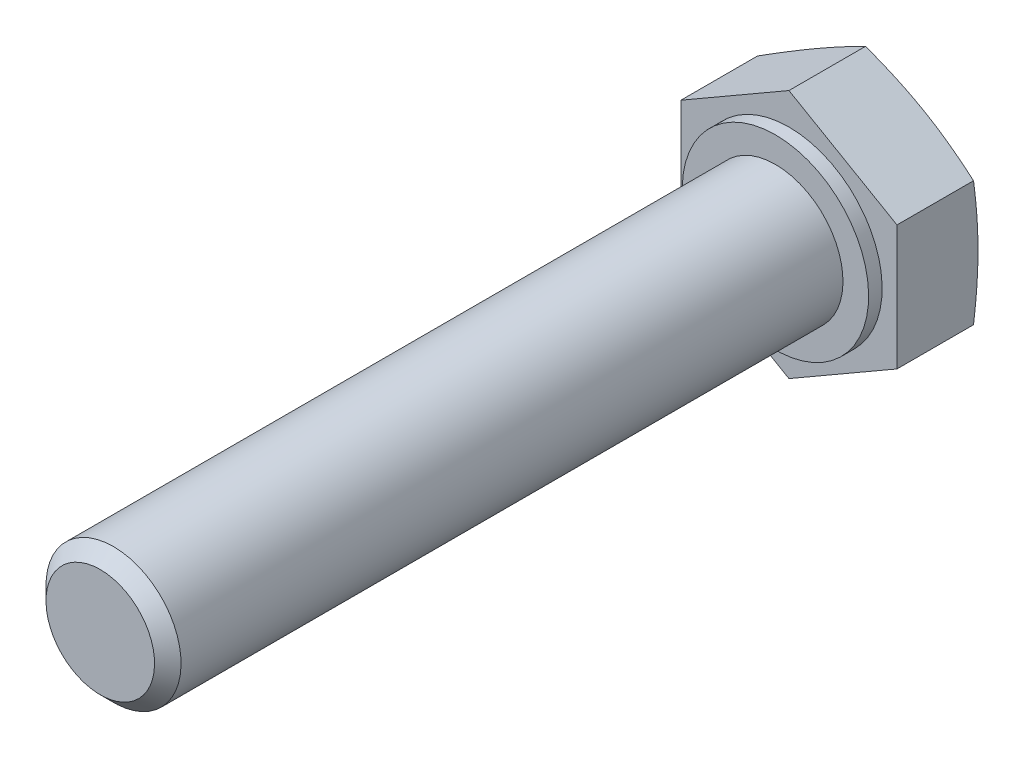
ISO-10303-21;
HEADER;
FILE_DESCRIPTION(('STEP AP214'),'2;1');
FILE_NAME('part.step','',(''),(''),'','','');
FILE_SCHEMA(('AUTOMOTIVE_DESIGN { 1 0 10303 214 1 1 1 1 }'));
ENDSEC;
DATA;
#1=APPLICATION_CONTEXT('core data for automotive mechanical design processes');
#2=APPLICATION_PROTOCOL_DEFINITION('international standard','automotive_design',2000,#1);
#3=PRODUCT_CONTEXT('',#1,'mechanical');
#4=PRODUCT('Part','Part','',(#3));
#5=PRODUCT_RELATED_PRODUCT_CATEGORY('part','',(#4));
#6=PRODUCT_DEFINITION_FORMATION('','',#4);
#7=PRODUCT_DEFINITION_CONTEXT('part definition',#1,'design');
#8=PRODUCT_DEFINITION('design','',#6,#7);
#9=PRODUCT_DEFINITION_SHAPE('','',#8);
#10=(LENGTH_UNIT() NAMED_UNIT(*) SI_UNIT(.MILLI.,.METRE.));
#11=(NAMED_UNIT(*) PLANE_ANGLE_UNIT() SI_UNIT($,.RADIAN.));
#12=(NAMED_UNIT(*) SI_UNIT($,.STERADIAN.) SOLID_ANGLE_UNIT());
#13=UNCERTAINTY_MEASURE_WITH_UNIT(LENGTH_MEASURE(1.E-05),#10,'distance_accuracy_value','');
#14=(GEOMETRIC_REPRESENTATION_CONTEXT(3) GLOBAL_UNCERTAINTY_ASSIGNED_CONTEXT((#13)) GLOBAL_UNIT_ASSIGNED_CONTEXT((#10,
#11,#12)) REPRESENTATION_CONTEXT('',''));
#15=CARTESIAN_POINT('',(0.,0.,0.));
#16=DIRECTION('',(0.,0.,1.));
#17=DIRECTION('',(1.,0.,0.));
#18=AXIS2_PLACEMENT_3D('',#15,#16,#17);
#19=CARTESIAN_POINT('',(0.,-8.,3.));
#20=DIRECTION('',(0.,0.,1.));
#21=DIRECTION('',(0.,-1.,0.));
#22=AXIS2_PLACEMENT_3D('',#19,#20,#21);
#23=PLANE('',#22);
#24=CARTESIAN_POINT('',(0.,0.,3.));
#25=DIRECTION('',(0.,0.,-1.));
#26=DIRECTION('',(0.,1.,0.));
#27=AXIS2_PLACEMENT_3D('',#24,#25,#26);
#28=CIRCLE('',#27,3.45);
#29=CARTESIAN_POINT('',(0.,3.45,3.));
#30=VERTEX_POINT('',#29);
#31=EDGE_CURVE('E159',#30,#30,#28,.T.);
#32=ORIENTED_EDGE('',*,*,#31,.T.);
#33=EDGE_LOOP('',(#32));
#34=FACE_BOUND('',#33,.T.);
#35=DIRECTION('',(0.,1.,0.));
#36=VECTOR('',#35,1.);
#37=CARTESIAN_POINT('',(4.,-8.,3.));
#38=LINE('',#37,#36);
#39=CARTESIAN_POINT('',(4.,-2.30940107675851,3.));
#40=VERTEX_POINT('',#39);
#41=CARTESIAN_POINT('',(4.,2.30940107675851,3.));
#42=VERTEX_POINT('',#41);
#43=EDGE_CURVE('E161',#40,#42,#38,.T.);
#44=ORIENTED_EDGE('',*,*,#43,.T.);
#45=DIRECTION('',(-0.866025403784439,0.5,0.));
#46=VECTOR('',#45,1.);
#47=CARTESIAN_POINT('',(5.46410161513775,1.46410161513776,3.));
#48=LINE('',#47,#46);
#49=CARTESIAN_POINT('',(0.,4.61880215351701,3.));
#50=VERTEX_POINT('',#49);
#51=EDGE_CURVE('E9',#42,#50,#48,.T.);
#52=ORIENTED_EDGE('',*,*,#51,.T.);
#53=DIRECTION('',(-0.866025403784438,-0.5,0.));
#54=VECTOR('',#53,1.);
#55=CARTESIAN_POINT('',(-5.46410161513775,1.46410161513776,3.));
#56=LINE('',#55,#54);
#57=CARTESIAN_POINT('',(-4.,2.30940107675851,3.));
#58=VERTEX_POINT('',#57);
#59=EDGE_CURVE('E22',#50,#58,#56,.T.);
#60=ORIENTED_EDGE('',*,*,#59,.T.);
#61=DIRECTION('',(0.,-1.,0.));
#62=VECTOR('',#61,1.);
#63=CARTESIAN_POINT('',(-4.,-8.,3.));
#64=LINE('',#63,#62);
#65=CARTESIAN_POINT('',(-4.,-2.30940107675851,3.));
#66=VERTEX_POINT('',#65);
#67=EDGE_CURVE('E174',#58,#66,#64,.T.);
#68=ORIENTED_EDGE('',*,*,#67,.T.);
#69=DIRECTION('',(0.866025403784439,-0.5,0.));
#70=VECTOR('',#69,1.);
#71=CARTESIAN_POINT('',(1.46410161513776,-5.46410161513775,3.));
#72=LINE('',#71,#70);
#73=CARTESIAN_POINT('',(0.,-4.61880215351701,3.));
#74=VERTEX_POINT('',#73);
#75=EDGE_CURVE('E166',#66,#74,#72,.T.);
#76=ORIENTED_EDGE('',*,*,#75,.T.);
#77=DIRECTION('',(0.866025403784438,0.5,0.));
#78=VECTOR('',#77,1.);
#79=CARTESIAN_POINT('',(-1.46410161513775,-5.46410161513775,3.));
#80=LINE('',#79,#78);
#81=EDGE_CURVE('E164',#74,#40,#80,.T.);
#82=ORIENTED_EDGE('',*,*,#81,.T.);
#83=EDGE_LOOP('',(#44,#52,#60,#68,#76,#82));
#84=FACE_BOUND('',#83,.T.);
#85=ADVANCED_FACE('F14',(#34,#84),#23,.T.);
#86=CARTESIAN_POINT('',(0.,0.,28.5));
#87=DIRECTION('',(0.,0.,-1.));
#88=DIRECTION('',(0.,1.,0.));
#89=AXIS2_PLACEMENT_3D('',#86,#87,#88);
#90=CYLINDRICAL_SURFACE('',#89,3.45);
#91=CARTESIAN_POINT('',(0.,0.,3.5));
#92=DIRECTION('',(0.,0.,-1.));
#93=DIRECTION('',(0.,1.,0.));
#94=AXIS2_PLACEMENT_3D('',#91,#92,#93);
#95=CIRCLE('',#94,3.45);
#96=CARTESIAN_POINT('',(0.,3.45,3.5));
#97=VERTEX_POINT('',#96);
#98=EDGE_CURVE('E252',#97,#97,#95,.T.);
#99=ORIENTED_EDGE('',*,*,#98,.T.);
#100=EDGE_LOOP('',(#99));
#101=FACE_BOUND('',#100,.T.);
#102=ORIENTED_EDGE('',*,*,#31,.F.);
#103=EDGE_LOOP('',(#102));
#104=FACE_BOUND('',#103,.T.);
#105=ADVANCED_FACE('F147',(#101,#104),#90,.T.);
#106=CARTESIAN_POINT('',(0.,-3.45,3.5));
#107=DIRECTION('',(0.,0.,1.));
#108=DIRECTION('',(0.,-1.,0.));
#109=AXIS2_PLACEMENT_3D('',#106,#107,#108);
#110=PLANE('',#109);
#111=CARTESIAN_POINT('',(0.,0.,3.5));
#112=DIRECTION('',(0.,0.,-1.));
#113=DIRECTION('',(0.,1.,0.));
#114=AXIS2_PLACEMENT_3D('',#111,#112,#113);
#115=CIRCLE('',#114,2.5);
#116=CARTESIAN_POINT('',(0.,2.5,3.5));
#117=VERTEX_POINT('',#116);
#118=EDGE_CURVE('E254',#117,#117,#115,.T.);
#119=ORIENTED_EDGE('',*,*,#118,.T.);
#120=EDGE_LOOP('',(#119));
#121=FACE_BOUND('',#120,.T.);
#122=ORIENTED_EDGE('',*,*,#98,.F.);
#123=EDGE_LOOP('',(#122));
#124=FACE_BOUND('',#123,.T.);
#125=ADVANCED_FACE('F143',(#121,#124),#110,.T.);
#126=CARTESIAN_POINT('',(0.,0.,28.5));
#127=DIRECTION('',(0.,0.,-1.));
#128=DIRECTION('',(0.,1.,0.));
#129=AXIS2_PLACEMENT_3D('',#126,#127,#128);
#130=CYLINDRICAL_SURFACE('',#129,2.5);
#131=CARTESIAN_POINT('',(0.,0.,28.0095));
#132=DIRECTION('',(0.,0.,-1.));
#133=DIRECTION('',(0.,1.,0.));
#134=AXIS2_PLACEMENT_3D('',#131,#132,#133);
#135=CIRCLE('',#134,2.5);
#136=CARTESIAN_POINT('',(0.,2.5,28.0095));
#137=VERTEX_POINT('',#136);
#138=EDGE_CURVE('E258',#137,#137,#135,.T.);
#139=ORIENTED_EDGE('',*,*,#138,.T.);
#140=EDGE_LOOP('',(#139));
#141=FACE_BOUND('',#140,.T.);
#142=ORIENTED_EDGE('',*,*,#118,.F.);
#143=EDGE_LOOP('',(#142));
#144=FACE_BOUND('',#143,.T.);
#145=ADVANCED_FACE('F139',(#141,#144),#130,.T.);
#146=CARTESIAN_POINT('',(0.,0.,28.0095));
#147=DIRECTION('',(0.,0.,-1.));
#148=DIRECTION('',(0.,1.,0.));
#149=AXIS2_PLACEMENT_3D('',#146,#147,#148);
#150=CONICAL_SURFACE('',#149,2.5,0.785398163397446);
#151=CARTESIAN_POINT('',(0.,0.,28.5));
#152=DIRECTION('',(0.,0.,-1.));
#153=DIRECTION('',(0.,1.,0.));
#154=AXIS2_PLACEMENT_3D('',#151,#152,#153);
#155=CIRCLE('',#154,2.0095);
#156=CARTESIAN_POINT('',(0.,2.0095,28.5));
#157=VERTEX_POINT('',#156);
#158=EDGE_CURVE('E105',#157,#157,#155,.T.);
#159=ORIENTED_EDGE('',*,*,#158,.T.);
#160=EDGE_LOOP('',(#159));
#161=FACE_BOUND('',#160,.T.);
#162=ORIENTED_EDGE('',*,*,#138,.F.);
#163=EDGE_LOOP('',(#162));
#164=FACE_BOUND('',#163,.T.);
#165=ADVANCED_FACE('F135',(#161,#164),#150,.T.);
#166=CARTESIAN_POINT('',(0.,-2.0095,28.5));
#167=DIRECTION('',(0.,0.,1.));
#168=DIRECTION('',(0.,-1.,0.));
#169=AXIS2_PLACEMENT_3D('',#166,#167,#168);
#170=PLANE('',#169);
#171=ORIENTED_EDGE('',*,*,#158,.F.);
#172=EDGE_LOOP('',(#171));
#173=FACE_BOUND('',#172,.T.);
#174=ADVANCED_FACE('F130',(#173),#170,.T.);
#175=CARTESIAN_POINT('',(4.,2.30940107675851,0.));
#176=DIRECTION('',(0.5,0.866025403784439,0.));
#177=DIRECTION('',(-0.866025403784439,0.5,0.));
#178=AXIS2_PLACEMENT_3D('',#175,#176,#177);
#179=PLANE('',#178);
#180=DIRECTION('',(0.,0.,1.));
#181=VECTOR('',#180,1.);
#182=CARTESIAN_POINT('',(0.,4.61880215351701,0.));
#183=LINE('',#182,#181);
#184=CARTESIAN_POINT('',(0.,4.61880215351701,0.16580753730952));
#185=VERTEX_POINT('',#184);
#186=EDGE_CURVE('E179',#185,#50,#183,.T.);
#187=ORIENTED_EDGE('',*,*,#186,.T.);
#188=ORIENTED_EDGE('',*,*,#51,.F.);
#189=DIRECTION('',(0.,0.,1.));
#190=VECTOR('',#189,1.);
#191=CARTESIAN_POINT('',(4.,2.30940107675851,0.));
#192=LINE('',#191,#190);
#193=CARTESIAN_POINT('',(4.,2.30940107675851,0.16580753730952));
#194=VERTEX_POINT('',#193);
#195=EDGE_CURVE('E35',#194,#42,#192,.T.);
#196=ORIENTED_EDGE('',*,*,#195,.F.);
#197=CARTESIAN_POINT('',(-0.000199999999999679,4.61891762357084,0.165838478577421));
#198=CARTESIAN_POINT('',(0.165926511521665,4.52300443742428,0.140126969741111));
#199=CARTESIAN_POINT('',(0.33235424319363,4.42691734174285,0.116785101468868));
#200=CARTESIAN_POINT('',(0.665797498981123,4.23440378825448,0.0757755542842));
#201=CARTESIAN_POINT('',(0.832813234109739,4.13797720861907,0.0581101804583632));
#202=CARTESIAN_POINT('',(1.16641980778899,3.94536936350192,0.0294849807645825));
#203=CARTESIAN_POINT('',(1.33300839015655,3.84918940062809,0.0184910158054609));
#204=CARTESIAN_POINT('',(1.66639801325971,3.65670681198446,0.00374922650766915));
#205=CARTESIAN_POINT('',(1.83319900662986,3.56040421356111,0.));
#206=CARTESIAN_POINT('',(2.16680099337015,3.3677990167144,0.));
#207=CARTESIAN_POINT('',(2.3336019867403,3.27149641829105,0.00374922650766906));
#208=CARTESIAN_POINT('',(2.66699160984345,3.07901382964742,0.0184910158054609));
#209=CARTESIAN_POINT('',(2.83358019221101,2.98283386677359,0.0294849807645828));
#210=CARTESIAN_POINT('',(3.16718676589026,2.79022602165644,0.0581101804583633));
#211=CARTESIAN_POINT('',(3.33420250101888,2.69379944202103,0.0757755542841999));
#212=CARTESIAN_POINT('',(3.66764575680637,2.50128588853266,0.116785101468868));
#213=CARTESIAN_POINT('',(3.83407348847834,2.40519879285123,0.140126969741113));
#214=CARTESIAN_POINT('',(4.0002,2.30928560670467,0.165838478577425));
#215=B_SPLINE_CURVE_WITH_KNOTS('',3,(#197,#198,#199,#200,#201,#202,#203,#204,#205,#206,#207,
#208,#209,#210,#211,#212,#213,#214),.UNSPECIFIED.,.F.,.F.,(4,2,2,2,2,2,2,2,4),(0.,
0.580655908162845,1.1615473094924,1.73944052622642,2.31722188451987,2.89500324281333,
3.47289645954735,4.0537878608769,4.63444376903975),.UNSPECIFIED.);
#216=CARTESIAN_POINT('',(2.,3.46410161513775,0.));
#217=VERTEX_POINT('',#216);
#218=EDGE_CURVE('E95',#217,#194,#215,.T.);
#219=ORIENTED_EDGE('',*,*,#218,.F.);
#220=EDGE_CURVE('E102',#185,#217,#215,.T.);
#221=ORIENTED_EDGE('',*,*,#220,.F.);
#222=EDGE_LOOP('',(#187,#188,#196,#219,#221));
#223=FACE_BOUND('',#222,.T.);
#224=ADVANCED_FACE('F94',(#223),#179,.T.);
#225=CARTESIAN_POINT('',(0.,4.61880215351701,0.));
#226=DIRECTION('',(-0.5,0.866025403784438,0.));
#227=DIRECTION('',(-0.866025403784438,-0.5,0.));
#228=AXIS2_PLACEMENT_3D('',#225,#226,#227);
#229=PLANE('',#228);
#230=DIRECTION('',(0.,0.,1.));
#231=VECTOR('',#230,1.);
#232=CARTESIAN_POINT('',(-4.,2.30940107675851,0.));
#233=LINE('',#232,#231);
#234=CARTESIAN_POINT('',(-4.,2.30940107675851,0.165807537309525));
#235=VERTEX_POINT('',#234);
#236=EDGE_CURVE('E182',#235,#58,#233,.T.);
#237=ORIENTED_EDGE('',*,*,#236,.T.);
#238=ORIENTED_EDGE('',*,*,#59,.F.);
#239=ORIENTED_EDGE('',*,*,#186,.F.);
#240=CARTESIAN_POINT('',(-4.0002,2.30928560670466,0.165838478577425));
#241=CARTESIAN_POINT('',(-3.83407348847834,2.40519879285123,0.140126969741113));
#242=CARTESIAN_POINT('',(-3.66764575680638,2.50128588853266,0.116785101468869));
#243=CARTESIAN_POINT('',(-3.33420250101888,2.69379944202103,0.0757755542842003));
#244=CARTESIAN_POINT('',(-3.16718676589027,2.79022602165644,0.0581101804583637));
#245=CARTESIAN_POINT('',(-2.83358019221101,2.98283386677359,0.0294849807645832));
#246=CARTESIAN_POINT('',(-2.66699160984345,3.07901382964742,0.0184910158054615));
#247=CARTESIAN_POINT('',(-2.3336019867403,3.27149641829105,0.00374922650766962));
#248=CARTESIAN_POINT('',(-2.16680099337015,3.3677990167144,0.));
#249=CARTESIAN_POINT('',(-1.83319900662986,3.56040421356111,0.));
#250=CARTESIAN_POINT('',(-1.66639801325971,3.65670681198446,0.00374922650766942));
#251=CARTESIAN_POINT('',(-1.33300839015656,3.84918940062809,0.0184910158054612));
#252=CARTESIAN_POINT('',(-1.16641980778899,3.94536936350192,0.0294849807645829));
#253=CARTESIAN_POINT('',(-0.832813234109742,4.13797720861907,0.0581101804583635));
#254=CARTESIAN_POINT('',(-0.665797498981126,4.23440378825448,0.0757755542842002));
#255=CARTESIAN_POINT('',(-0.332354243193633,4.42691734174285,0.116785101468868));
#256=CARTESIAN_POINT('',(-0.165926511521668,4.52300443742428,0.140126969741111));
#257=CARTESIAN_POINT('',(0.000199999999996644,4.61891762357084,0.165838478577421));
#258=B_SPLINE_CURVE_WITH_KNOTS('',3,(#240,#241,#242,#243,#244,#245,#246,#247,#248,#249,#250,
#251,#252,#253,#254,#255,#256,#257),.UNSPECIFIED.,.F.,.F.,(4,2,2,2,2,2,2,2,4),(0.,
0.580655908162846,1.1615473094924,1.73944052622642,2.31722188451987,2.89500324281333,
3.47289645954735,4.0537878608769,4.63444376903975),.UNSPECIFIED.);
#259=CARTESIAN_POINT('',(-2.,3.46410161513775,0.));
#260=VERTEX_POINT('',#259);
#261=EDGE_CURVE('E107',#260,#185,#258,.T.);
#262=ORIENTED_EDGE('',*,*,#261,.F.);
#263=EDGE_CURVE('E103',#235,#260,#258,.T.);
#264=ORIENTED_EDGE('',*,*,#263,.F.);
#265=EDGE_LOOP('',(#237,#238,#239,#262,#264));
#266=FACE_BOUND('',#265,.T.);
#267=ADVANCED_FACE('F129',(#266),#229,.T.);
#268=CARTESIAN_POINT('',(-4.,2.30940107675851,0.));
#269=DIRECTION('',(-1.,0.,0.));
#270=DIRECTION('',(0.,-1.,0.));
#271=AXIS2_PLACEMENT_3D('',#268,#269,#270);
#272=PLANE('',#271);
#273=DIRECTION('',(0.,0.,1.));
#274=VECTOR('',#273,1.);
#275=CARTESIAN_POINT('',(-4.,-2.30940107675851,0.));
#276=LINE('',#275,#274);
#277=CARTESIAN_POINT('',(-4.,-2.30940107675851,0.165807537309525));
#278=VERTEX_POINT('',#277);
#279=EDGE_CURVE('E184',#278,#66,#276,.T.);
#280=ORIENTED_EDGE('',*,*,#279,.T.);
#281=ORIENTED_EDGE('',*,*,#67,.F.);
#282=ORIENTED_EDGE('',*,*,#236,.F.);
#283=CARTESIAN_POINT('',(-4.,6.17119683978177,0.898744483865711));
#284=CARTESIAN_POINT('',(-4.,5.98899751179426,0.857788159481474));
#285=CARTESIAN_POINT('',(-4.,5.80668598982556,0.817322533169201));
#286=CARTESIAN_POINT('',(-4.,5.44178313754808,0.737637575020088));
#287=CARTESIAN_POINT('',(-4.,5.25919179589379,0.69841829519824));
#288=CARTESIAN_POINT('',(-4.,4.89351973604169,0.621458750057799));
#289=CARTESIAN_POINT('',(-4.,4.71043872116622,0.583719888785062));
#290=CARTESIAN_POINT('',(-4.,4.34390065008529,0.510118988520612));
#291=CARTESIAN_POINT('',(-4.,4.16044359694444,0.474256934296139));
#292=CARTESIAN_POINT('',(-4.,3.79457455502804,0.405137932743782));
#293=CARTESIAN_POINT('',(-4.,3.61216614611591,0.371862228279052));
#294=CARTESIAN_POINT('',(-4.,3.24685513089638,0.30815123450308));
#295=CARTESIAN_POINT('',(-4.,3.06395251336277,0.27771601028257));
#296=CARTESIAN_POINT('',(-4.,2.51443513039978,0.191656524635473));
#297=CARTESIAN_POINT('',(-4.,2.14694554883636,0.141265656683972));
#298=CARTESIAN_POINT('',(-4.,1.59190230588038,0.0808604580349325));
#299=CARTESIAN_POINT('',(-4.,1.40517901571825,0.0631992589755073));
#300=CARTESIAN_POINT('',(-4.,1.03124682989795,0.0340086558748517));
#301=CARTESIAN_POINT('',(-4.,0.844037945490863,0.0224791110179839));
#302=CARTESIAN_POINT('',(-4.,0.469412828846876,0.00621961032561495));
#303=CARTESIAN_POINT('',(-4.,0.281996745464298,0.00148628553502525));
#304=CARTESIAN_POINT('',(-4.,-0.0928810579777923,-0.00088742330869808));
#305=CARTESIAN_POINT('',(-4.,-0.280342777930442,0.00147217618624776));
#306=CARTESIAN_POINT('',(-4.,-0.655761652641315,0.0131530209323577));
#307=CARTESIAN_POINT('',(-4.,-0.843717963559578,0.0225008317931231));
#308=CARTESIAN_POINT('',(-4.,-1.21919691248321,0.0476203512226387));
#309=CARTESIAN_POINT('',(-4.,-1.4067195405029,0.0633922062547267));
#310=CARTESIAN_POINT('',(-4.,-1.78132954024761,0.100547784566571));
#311=CARTESIAN_POINT('',(-4.,-1.96841652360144,0.121935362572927));
#312=CARTESIAN_POINT('',(-4.,-2.34198560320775,0.16941383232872));
#313=CARTESIAN_POINT('',(-4.,-2.52846769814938,0.195504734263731));
#314=CARTESIAN_POINT('',(-4.,-2.89981892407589,0.251380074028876));
#315=CARTESIAN_POINT('',(-4.,-3.08469127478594,0.281143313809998));
#316=CARTESIAN_POINT('',(-4.,-3.45391519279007,0.343755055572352));
#317=CARTESIAN_POINT('',(-4.,-3.63826674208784,0.376603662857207));
#318=CARTESIAN_POINT('',(-4.,-4.19067442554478,0.478849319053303));
#319=CARTESIAN_POINT('',(-4.,-4.55804485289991,0.551940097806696));
#320=CARTESIAN_POINT('',(-4.,-5.29155686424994,0.704515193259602));
#321=CARTESIAN_POINT('',(-4.,-5.65769800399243,0.784001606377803));
#322=CARTESIAN_POINT('',(-4.,-6.38899634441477,0.947239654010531));
#323=CARTESIAN_POINT('',(-3.99999999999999,-6.75415361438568,1.03099097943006));
#324=CARTESIAN_POINT('',(-3.99999999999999,-7.47987161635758,1.20052176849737));
#325=CARTESIAN_POINT('',(-3.99999999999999,-7.84043970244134,1.28626991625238));
#326=CARTESIAN_POINT('',(-3.99999999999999,-8.56108756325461,1.4598245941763));
#327=CARTESIAN_POINT('',(-3.99999999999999,-8.92116732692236,1.54763117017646));
#328=CARTESIAN_POINT('',(-3.99999999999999,-9.64044653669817,1.72462114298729));
#329=CARTESIAN_POINT('',(-3.99999999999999,-9.9996465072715,1.81380241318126));
#330=CARTESIAN_POINT('',(-3.99999999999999,-10.717746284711,1.99331080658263));
#331=CARTESIAN_POINT('',(-3.99999999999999,-11.0766461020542,2.08363788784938));
#332=CARTESIAN_POINT('',(-4.,-11.4354435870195,2.17436506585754));
#333=B_SPLINE_CURVE_WITH_KNOTS('',3,(#283,#284,#285,#286,#287,#288,#289,#290,#291,#292,#293,
#294,#295,#296,#297,#298,#299,#300,#301,#302,#303,#304,#305,#306,#307,#308,#309,#310,#311,#312,
#313,#314,#315,#316,#317,#318,#319,#320,#321,#322,#323,#324,#325,#326,#327,#328,#329,#330,#331,
#332),.UNSPECIFIED.,.F.,.F.,(4,2,2,2,2,2,2,2,2,2,2,2,2,2,2,2,2,2,2,2,2,2,2,2,4),(0.,
0.560239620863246,1.12050259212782,1.68128467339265,2.24206220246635,2.79829502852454,
3.35454059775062,4.46683223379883,5.02942093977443,5.59199672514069,6.15429353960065,
6.71658904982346,7.28103305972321,7.84548993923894,8.41033528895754,8.97518186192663,
9.53690839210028,10.0986541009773,11.2222631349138,12.3462419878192,13.4701394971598,
14.5820036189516,15.69389252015,16.8042063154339,17.9144795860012),.UNSPECIFIED.);
#334=CARTESIAN_POINT('',(-4.,0.,0.));
#335=VERTEX_POINT('',#334);
#336=EDGE_CURVE('E220',#335,#235,#333,.F.);
#337=ORIENTED_EDGE('',*,*,#336,.F.);
#338=EDGE_CURVE('E226',#278,#335,#333,.F.);
#339=ORIENTED_EDGE('',*,*,#338,.F.);
#340=EDGE_LOOP('',(#280,#281,#282,#337,#339));
#341=FACE_BOUND('',#340,.T.);
#342=ADVANCED_FACE('F214',(#341),#272,.T.);
#343=CARTESIAN_POINT('',(-4.,-2.30940107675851,0.));
#344=DIRECTION('',(-0.5,-0.866025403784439,0.));
#345=DIRECTION('',(0.866025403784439,-0.5,0.));
#346=AXIS2_PLACEMENT_3D('',#343,#344,#345);
#347=PLANE('',#346);
#348=DIRECTION('',(0.,0.,1.));
#349=VECTOR('',#348,1.);
#350=CARTESIAN_POINT('',(0.,-4.61880215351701,0.));
#351=LINE('',#350,#349);
#352=CARTESIAN_POINT('',(0.,-4.61880215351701,0.16580753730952));
#353=VERTEX_POINT('',#352);
#354=EDGE_CURVE('E272',#353,#74,#351,.T.);
#355=ORIENTED_EDGE('',*,*,#354,.T.);
#356=ORIENTED_EDGE('',*,*,#75,.F.);
#357=ORIENTED_EDGE('',*,*,#279,.F.);
#358=CARTESIAN_POINT('',(0.000199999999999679,-4.61891762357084,0.165838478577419));
#359=CARTESIAN_POINT('',(-0.165926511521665,-4.52300443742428,0.140126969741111));
#360=CARTESIAN_POINT('',(-0.33235424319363,-4.42691734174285,0.116785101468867));
#361=CARTESIAN_POINT('',(-0.665797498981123,-4.23440378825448,0.0757755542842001));
#362=CARTESIAN_POINT('',(-0.832813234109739,-4.13797720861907,0.0581101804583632));
#363=CARTESIAN_POINT('',(-1.16641980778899,-3.94536936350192,0.0294849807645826));
#364=CARTESIAN_POINT('',(-1.33300839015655,-3.84918940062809,0.0184910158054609));
#365=CARTESIAN_POINT('',(-1.66639801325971,-3.65670681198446,0.00374922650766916));
#366=CARTESIAN_POINT('',(-1.83319900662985,-3.56040421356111,0.));
#367=CARTESIAN_POINT('',(-2.16680099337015,-3.3677990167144,0.));
#368=CARTESIAN_POINT('',(-2.33360198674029,-3.27149641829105,0.00374922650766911));
#369=CARTESIAN_POINT('',(-2.66699160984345,-3.07901382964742,0.0184910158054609));
#370=CARTESIAN_POINT('',(-2.83358019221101,-2.98283386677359,0.0294849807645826));
#371=CARTESIAN_POINT('',(-3.16718676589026,-2.79022602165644,0.0581101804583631));
#372=CARTESIAN_POINT('',(-3.33420250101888,-2.69379944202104,0.0757755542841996));
#373=CARTESIAN_POINT('',(-3.66764575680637,-2.50128588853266,0.116785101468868));
#374=CARTESIAN_POINT('',(-3.83407348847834,-2.40519879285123,0.140126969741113));
#375=CARTESIAN_POINT('',(-4.0002,-2.30928560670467,0.165838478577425));
#376=B_SPLINE_CURVE_WITH_KNOTS('',3,(#358,#359,#360,#361,#362,#363,#364,#365,#366,#367,#368,
#369,#370,#371,#372,#373,#374,#375),.UNSPECIFIED.,.F.,.F.,(4,2,2,2,2,2,2,2,4),(0.,
0.580655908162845,1.1615473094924,1.73944052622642,2.31722188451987,2.89500324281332,
3.47289645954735,4.0537878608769,4.63444376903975),.UNSPECIFIED.);
#377=CARTESIAN_POINT('',(-2.,-3.46410161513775,0.));
#378=VERTEX_POINT('',#377);
#379=EDGE_CURVE('E200',#378,#278,#376,.T.);
#380=ORIENTED_EDGE('',*,*,#379,.F.);
#381=EDGE_CURVE('E227',#353,#378,#376,.T.);
#382=ORIENTED_EDGE('',*,*,#381,.F.);
#383=EDGE_LOOP('',(#355,#356,#357,#380,#382));
#384=FACE_BOUND('',#383,.T.);
#385=ADVANCED_FACE('F209',(#384),#347,.T.);
#386=CARTESIAN_POINT('',(0.,-4.61880215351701,0.));
#387=DIRECTION('',(0.5,-0.866025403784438,0.));
#388=DIRECTION('',(0.866025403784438,0.5,0.));
#389=AXIS2_PLACEMENT_3D('',#386,#387,#388);
#390=PLANE('',#389);
#391=DIRECTION('',(0.,0.,1.));
#392=VECTOR('',#391,1.);
#393=CARTESIAN_POINT('',(4.,-2.30940107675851,0.));
#394=LINE('',#393,#392);
#395=CARTESIAN_POINT('',(4.,-2.30940107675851,0.16580753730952));
#396=VERTEX_POINT('',#395);
#397=EDGE_CURVE('E29',#396,#40,#394,.T.);
#398=ORIENTED_EDGE('',*,*,#397,.T.);
#399=ORIENTED_EDGE('',*,*,#81,.F.);
#400=ORIENTED_EDGE('',*,*,#354,.F.);
#401=CARTESIAN_POINT('',(4.0002,-2.30928560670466,0.165838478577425));
#402=CARTESIAN_POINT('',(3.83407348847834,-2.40519879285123,0.140126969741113));
#403=CARTESIAN_POINT('',(3.66764575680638,-2.50128588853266,0.116785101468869));
#404=CARTESIAN_POINT('',(3.33420250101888,-2.69379944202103,0.0757755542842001));
#405=CARTESIAN_POINT('',(3.16718676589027,-2.79022602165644,0.0581101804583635));
#406=CARTESIAN_POINT('',(2.83358019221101,-2.98283386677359,0.029484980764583));
#407=CARTESIAN_POINT('',(2.66699160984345,-3.07901382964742,0.0184910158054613));
#408=CARTESIAN_POINT('',(2.3336019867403,-3.27149641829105,0.00374922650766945));
#409=CARTESIAN_POINT('',(2.16680099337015,-3.3677990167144,0.));
#410=CARTESIAN_POINT('',(1.83319900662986,-3.56040421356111,0.));
#411=CARTESIAN_POINT('',(1.66639801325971,-3.65670681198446,0.00374922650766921));
#412=CARTESIAN_POINT('',(1.33300839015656,-3.84918940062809,0.0184910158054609));
#413=CARTESIAN_POINT('',(1.166419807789,-3.94536936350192,0.0294849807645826));
#414=CARTESIAN_POINT('',(0.832813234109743,-4.13797720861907,0.0581101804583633));
#415=CARTESIAN_POINT('',(0.665797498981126,-4.23440378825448,0.0757755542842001));
#416=CARTESIAN_POINT('',(0.332354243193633,-4.42691734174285,0.116785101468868));
#417=CARTESIAN_POINT('',(0.165926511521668,-4.52300443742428,0.140126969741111));
#418=CARTESIAN_POINT('',(-0.000199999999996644,-4.61891762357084,0.165838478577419));
#419=B_SPLINE_CURVE_WITH_KNOTS('',3,(#401,#402,#403,#404,#405,#406,#407,#408,#409,#410,#411,
#412,#413,#414,#415,#416,#417,#418),.UNSPECIFIED.,.F.,.F.,(4,2,2,2,2,2,2,2,4),(0.,
0.580655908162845,1.1615473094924,1.73944052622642,2.31722188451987,2.89500324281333,
3.47289645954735,4.0537878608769,4.63444376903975),.UNSPECIFIED.);
#420=CARTESIAN_POINT('',(2.,-3.46410161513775,0.));
#421=VERTEX_POINT('',#420);
#422=EDGE_CURVE('E90',#421,#353,#419,.T.);
#423=ORIENTED_EDGE('',*,*,#422,.F.);
#424=EDGE_CURVE('E199',#396,#421,#419,.T.);
#425=ORIENTED_EDGE('',*,*,#424,.F.);
#426=EDGE_LOOP('',(#398,#399,#400,#423,#425));
#427=FACE_BOUND('',#426,.T.);
#428=ADVANCED_FACE('F206',(#427),#390,.T.);
#429=CARTESIAN_POINT('',(4.,-2.30940107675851,0.));
#430=DIRECTION('',(1.,0.,0.));
#431=DIRECTION('',(0.,1.,0.));
#432=AXIS2_PLACEMENT_3D('',#429,#430,#431);
#433=PLANE('',#432);
#434=ORIENTED_EDGE('',*,*,#195,.T.);
#435=ORIENTED_EDGE('',*,*,#43,.F.);
#436=ORIENTED_EDGE('',*,*,#397,.F.);
#437=CARTESIAN_POINT('',(4.,6.17119683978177,0.898744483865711));
#438=CARTESIAN_POINT('',(4.,5.98899751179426,0.857788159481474));
#439=CARTESIAN_POINT('',(4.,5.80668598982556,0.8173225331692));
#440=CARTESIAN_POINT('',(3.99999999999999,5.44178313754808,0.737637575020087));
#441=CARTESIAN_POINT('',(4.,5.25919179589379,0.698418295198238));
#442=CARTESIAN_POINT('',(4.,4.89351973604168,0.621458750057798));
#443=CARTESIAN_POINT('',(4.,4.71043872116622,0.58371988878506));
#444=CARTESIAN_POINT('',(4.,4.34390065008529,0.510118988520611));
#445=CARTESIAN_POINT('',(4.,4.16044359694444,0.474256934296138));
#446=CARTESIAN_POINT('',(4.,3.79457455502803,0.405137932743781));
#447=CARTESIAN_POINT('',(4.,3.61216614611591,0.371862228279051));
#448=CARTESIAN_POINT('',(4.,3.24685513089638,0.308151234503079));
#449=CARTESIAN_POINT('',(4.,3.06395251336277,0.277716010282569));
#450=CARTESIAN_POINT('',(4.,2.51443513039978,0.191656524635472));
#451=CARTESIAN_POINT('',(4.,2.14694554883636,0.141265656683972));
#452=CARTESIAN_POINT('',(4.,1.59190230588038,0.0808604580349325));
#453=CARTESIAN_POINT('',(4.,1.40517901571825,0.063199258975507));
#454=CARTESIAN_POINT('',(4.,1.03124682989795,0.034008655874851));
#455=CARTESIAN_POINT('',(4.,0.844037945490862,0.0224791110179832));
#456=CARTESIAN_POINT('',(4.,0.469412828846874,0.0062196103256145));
#457=CARTESIAN_POINT('',(4.,0.281996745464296,0.00148628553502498));
#458=CARTESIAN_POINT('',(4.,-0.0928810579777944,-0.000887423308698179));
#459=CARTESIAN_POINT('',(4.,-0.280342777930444,0.00147217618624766));
#460=CARTESIAN_POINT('',(4.,-0.655761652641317,0.0131530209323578));
#461=CARTESIAN_POINT('',(4.,-0.843717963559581,0.0225008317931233));
#462=CARTESIAN_POINT('',(4.,-1.21919691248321,0.0476203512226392));
#463=CARTESIAN_POINT('',(4.,-1.4067195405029,0.0633922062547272));
#464=CARTESIAN_POINT('',(4.,-1.78132954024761,0.100547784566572));
#465=CARTESIAN_POINT('',(4.,-1.96841652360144,0.121935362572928));
#466=CARTESIAN_POINT('',(4.,-2.34198560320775,0.16941383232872));
#467=CARTESIAN_POINT('',(4.,-2.52846769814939,0.195504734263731));
#468=CARTESIAN_POINT('',(4.,-2.8998189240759,0.251380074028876));
#469=CARTESIAN_POINT('',(4.,-3.08469127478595,0.281143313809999));
#470=CARTESIAN_POINT('',(4.,-3.45391519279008,0.343755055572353));
#471=CARTESIAN_POINT('',(4.,-3.63826674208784,0.376603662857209));
#472=CARTESIAN_POINT('',(4.,-4.19067442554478,0.478849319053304));
#473=CARTESIAN_POINT('',(4.,-4.55804485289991,0.551940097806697));
#474=CARTESIAN_POINT('',(4.,-5.29155686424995,0.704515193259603));
#475=CARTESIAN_POINT('',(4.,-5.65769800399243,0.784001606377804));
#476=CARTESIAN_POINT('',(4.,-6.38899634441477,0.947239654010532));
#477=CARTESIAN_POINT('',(4.,-6.75415361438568,1.03099097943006));
#478=CARTESIAN_POINT('',(4.,-7.47987161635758,1.20052176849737));
#479=CARTESIAN_POINT('',(4.,-7.84043970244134,1.28626991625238));
#480=CARTESIAN_POINT('',(4.,-8.56108756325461,1.4598245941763));
#481=CARTESIAN_POINT('',(4.,-8.92116732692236,1.54763117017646));
#482=CARTESIAN_POINT('',(4.,-9.64044653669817,1.72462114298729));
#483=CARTESIAN_POINT('',(4.,-9.9996465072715,1.81380241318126));
#484=CARTESIAN_POINT('',(4.,-10.717746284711,1.99331080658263));
#485=CARTESIAN_POINT('',(4.,-11.0766461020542,2.08363788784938));
#486=CARTESIAN_POINT('',(4.,-11.4354435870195,2.17436506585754));
#487=B_SPLINE_CURVE_WITH_KNOTS('',3,(#437,#438,#439,#440,#441,#442,#443,#444,#445,#446,#447,
#448,#449,#450,#451,#452,#453,#454,#455,#456,#457,#458,#459,#460,#461,#462,#463,#464,#465,#466,
#467,#468,#469,#470,#471,#472,#473,#474,#475,#476,#477,#478,#479,#480,#481,#482,#483,#484,#485,
#486),.UNSPECIFIED.,.F.,.F.,(4,2,2,2,2,2,2,2,2,2,2,2,2,2,2,2,2,2,2,2,2,2,2,2,4),(0.,
0.560239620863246,1.12050259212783,1.68128467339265,2.24206220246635,2.79829502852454,
3.35454059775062,4.46683223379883,5.02942093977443,5.59199672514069,6.15429353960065,
6.71658904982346,7.28103305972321,7.84548993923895,8.41033528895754,8.97518186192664,
9.53690839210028,10.0986541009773,11.2222631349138,12.3462419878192,13.4701394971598,
14.5820036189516,15.69389252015,16.8042063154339,17.9144795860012),.UNSPECIFIED.);
#488=CARTESIAN_POINT('',(4.,0.,0.));
#489=VERTEX_POINT('',#488);
#490=EDGE_CURVE('E85',#489,#396,#487,.T.);
#491=ORIENTED_EDGE('',*,*,#490,.F.);
#492=EDGE_CURVE('E82',#194,#489,#487,.T.);
#493=ORIENTED_EDGE('',*,*,#492,.F.);
#494=EDGE_LOOP('',(#434,#435,#436,#491,#493));
#495=FACE_BOUND('',#494,.T.);
#496=ADVANCED_FACE('F83',(#495),#433,.T.);
#497=CARTESIAN_POINT('',(0.,0.,0.));
#498=DIRECTION('',(0.,0.,1.));
#499=DIRECTION('',(0.,-1.,0.));
#500=AXIS2_PLACEMENT_3D('',#497,#498,#499);
#501=CONICAL_SURFACE('',#500,4.,1.30899693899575);
#502=CARTESIAN_POINT('',(0.,0.,0.));
#503=DIRECTION('',(0.,0.,-1.));
#504=DIRECTION('',(0.,1.,0.));
#505=AXIS2_PLACEMENT_3D('',#502,#503,#504);
#506=CIRCLE('',#505,4.);
#507=EDGE_CURVE('E170',#260,#217,#506,.T.);
#508=ORIENTED_EDGE('',*,*,#507,.F.);
#509=ORIENTED_EDGE('',*,*,#261,.T.);
#510=ORIENTED_EDGE('',*,*,#220,.T.);
#511=EDGE_LOOP('',(#508,#509,#510));
#512=FACE_BOUND('',#511,.T.);
#513=ADVANCED_FACE('F276',(#512),#501,.T.);
#514=EDGE_CURVE('E250',#335,#260,#506,.T.);
#515=ORIENTED_EDGE('',*,*,#514,.F.);
#516=ORIENTED_EDGE('',*,*,#336,.T.);
#517=ORIENTED_EDGE('',*,*,#263,.T.);
#518=EDGE_LOOP('',(#515,#516,#517));
#519=FACE_BOUND('',#518,.T.);
#520=ADVANCED_FACE('F271',(#519),#501,.T.);
#521=ORIENTED_EDGE('',*,*,#379,.T.);
#522=ORIENTED_EDGE('',*,*,#338,.T.);
#523=EDGE_CURVE('E246',#378,#335,#506,.T.);
#524=ORIENTED_EDGE('',*,*,#523,.F.);
#525=EDGE_LOOP('',(#521,#522,#524));
#526=FACE_BOUND('',#525,.T.);
#527=ADVANCED_FACE('F122',(#526),#501,.T.);
#528=ORIENTED_EDGE('',*,*,#422,.T.);
#529=ORIENTED_EDGE('',*,*,#381,.T.);
#530=EDGE_CURVE('E242',#421,#378,#506,.T.);
#531=ORIENTED_EDGE('',*,*,#530,.F.);
#532=EDGE_LOOP('',(#528,#529,#531));
#533=FACE_BOUND('',#532,.T.);
#534=ADVANCED_FACE('F243',(#533),#501,.T.);
#535=EDGE_CURVE('E101',#217,#489,#506,.T.);
#536=ORIENTED_EDGE('',*,*,#535,.F.);
#537=ORIENTED_EDGE('',*,*,#218,.T.);
#538=ORIENTED_EDGE('',*,*,#492,.T.);
#539=EDGE_LOOP('',(#536,#537,#538));
#540=FACE_BOUND('',#539,.T.);
#541=ADVANCED_FACE('F99',(#540),#501,.T.);
#542=CARTESIAN_POINT('',(0.,0.,0.));
#543=DIRECTION('',(0.,0.,-1.));
#544=DIRECTION('',(0.,1.,0.));
#545=AXIS2_PLACEMENT_3D('',#542,#543,#544);
#546=PLANE('',#545);
#547=ORIENTED_EDGE('',*,*,#535,.T.);
#548=EDGE_CURVE('E168',#489,#421,#506,.T.);
#549=ORIENTED_EDGE('',*,*,#548,.T.);
#550=ORIENTED_EDGE('',*,*,#530,.T.);
#551=ORIENTED_EDGE('',*,*,#523,.T.);
#552=ORIENTED_EDGE('',*,*,#514,.T.);
#553=ORIENTED_EDGE('',*,*,#507,.T.);
#554=EDGE_LOOP('',(#547,#549,#550,#551,#552,#553));
#555=FACE_BOUND('',#554,.T.);
#556=ADVANCED_FACE('F16',(#555),#546,.T.);
#557=ORIENTED_EDGE('',*,*,#490,.T.);
#558=ORIENTED_EDGE('',*,*,#424,.T.);
#559=ORIENTED_EDGE('',*,*,#548,.F.);
#560=EDGE_LOOP('',(#557,#558,#559));
#561=FACE_BOUND('',#560,.T.);
#562=ADVANCED_FACE('F239',(#561),#501,.T.);
#563=CLOSED_SHELL('',(#85,#105,#125,#145,#165,#174,#224,#267,#342,#385,#428,#496,#513,#520,#527,
#534,#541,#556,#562));
#564=MANIFOLD_SOLID_BREP('B1',#563);
#565=ADVANCED_BREP_SHAPE_REPRESENTATION('',(#18,#564),#14);
#566=SHAPE_DEFINITION_REPRESENTATION(#9,#565);
ENDSEC;
END-ISO-10303-21;
